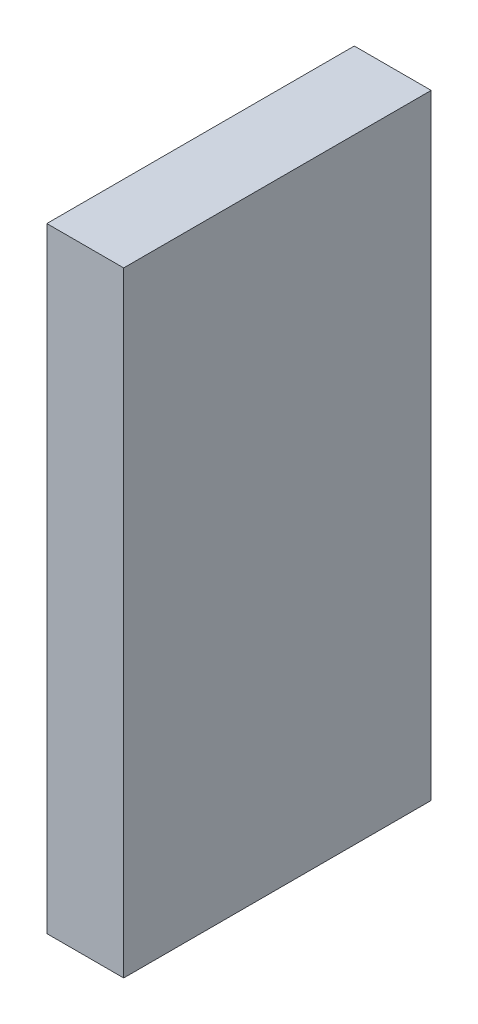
ISO-10303-21;
HEADER;
FILE_DESCRIPTION(('STEP AP214'),'2;1');
FILE_NAME('part.step','',(''),(''),'','','');
FILE_SCHEMA(('AUTOMOTIVE_DESIGN { 1 0 10303 214 1 1 1 1 }'));
ENDSEC;
DATA;
#1=APPLICATION_CONTEXT('core data for automotive mechanical design processes');
#2=APPLICATION_PROTOCOL_DEFINITION('international standard','automotive_design',2000,#1);
#3=PRODUCT_CONTEXT('',#1,'mechanical');
#4=PRODUCT('Part','Part','',(#3));
#5=PRODUCT_RELATED_PRODUCT_CATEGORY('part','',(#4));
#6=PRODUCT_DEFINITION_FORMATION('','',#4);
#7=PRODUCT_DEFINITION_CONTEXT('part definition',#1,'design');
#8=PRODUCT_DEFINITION('design','',#6,#7);
#9=PRODUCT_DEFINITION_SHAPE('','',#8);
#10=(LENGTH_UNIT() NAMED_UNIT(*) SI_UNIT(.MILLI.,.METRE.));
#11=(NAMED_UNIT(*) PLANE_ANGLE_UNIT() SI_UNIT($,.RADIAN.));
#12=(NAMED_UNIT(*) SI_UNIT($,.STERADIAN.) SOLID_ANGLE_UNIT());
#13=UNCERTAINTY_MEASURE_WITH_UNIT(LENGTH_MEASURE(1.E-05),#10,'distance_accuracy_value','');
#14=(GEOMETRIC_REPRESENTATION_CONTEXT(3) GLOBAL_UNCERTAINTY_ASSIGNED_CONTEXT((#13)) GLOBAL_UNIT_ASSIGNED_CONTEXT((#10,
#11,#12)) REPRESENTATION_CONTEXT('',''));
#15=CARTESIAN_POINT('',(0.,0.,0.));
#16=DIRECTION('',(0.,0.,1.));
#17=DIRECTION('',(1.,0.,0.));
#18=AXIS2_PLACEMENT_3D('',#15,#16,#17);
#19=CARTESIAN_POINT('',(14.5216968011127,27.7339360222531,-30.1556443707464));
#20=DIRECTION('',(-1.,0.,0.));
#21=DIRECTION('',(0.,-1.,0.));
#22=AXIS2_PLACEMENT_3D('',#19,#20,#21);
#23=PLANE('',#22);
#24=DIRECTION('',(0.,1.,0.));
#25=VECTOR('',#24,1.);
#26=CARTESIAN_POINT('',(14.5216968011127,27.7339360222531,-10.));
#27=LINE('',#26,#25);
#28=CARTESIAN_POINT('',(14.5216968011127,7.73393602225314,-10.));
#29=VERTEX_POINT('',#28);
#30=CARTESIAN_POINT('',(14.5216968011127,27.7339360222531,-10.));
#31=VERTEX_POINT('',#30);
#32=EDGE_CURVE('E59',#29,#31,#27,.T.);
#33=ORIENTED_EDGE('',*,*,#32,.F.);
#34=DIRECTION('',(0.,0.,1.));
#35=VECTOR('',#34,1.);
#36=CARTESIAN_POINT('',(14.5216968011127,7.73393602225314,-30.1556443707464));
#37=LINE('',#36,#35);
#38=CARTESIAN_POINT('',(14.5216968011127,7.73393602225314,0.));
#39=VERTEX_POINT('',#38);
#40=EDGE_CURVE('E85',#29,#39,#37,.T.);
#41=ORIENTED_EDGE('',*,*,#40,.T.);
#42=DIRECTION('',(0.,-1.,0.));
#43=VECTOR('',#42,1.);
#44=CARTESIAN_POINT('',(14.5216968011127,27.7339360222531,0.));
#45=LINE('',#44,#43);
#46=CARTESIAN_POINT('',(14.5216968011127,27.7339360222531,0.));
#47=VERTEX_POINT('',#46);
#48=EDGE_CURVE('E89',#47,#39,#45,.T.);
#49=ORIENTED_EDGE('',*,*,#48,.F.);
#50=DIRECTION('',(0.,0.,1.));
#51=VECTOR('',#50,1.);
#52=CARTESIAN_POINT('',(14.5216968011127,27.7339360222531,-30.1556443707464));
#53=LINE('',#52,#51);
#54=EDGE_CURVE('E130',#31,#47,#53,.T.);
#55=ORIENTED_EDGE('',*,*,#54,.F.);
#56=EDGE_LOOP('',(#33,#41,#49,#55));
#57=FACE_BOUND('',#56,.T.);
#58=ADVANCED_FACE('F49',(#57),#23,.T.);
#59=CARTESIAN_POINT('',(14.5216968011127,27.7339360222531,-30.1556443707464));
#60=DIRECTION('',(0.,1.,0.));
#61=DIRECTION('',(0.,0.,1.));
#62=AXIS2_PLACEMENT_3D('',#59,#60,#61);
#63=PLANE('',#62);
#64=DIRECTION('',(1.,0.,0.));
#65=VECTOR('',#64,1.);
#66=CARTESIAN_POINT('',(14.5216968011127,27.7339360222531,-10.));
#67=LINE('',#66,#65);
#68=CARTESIAN_POINT('',(17.0216968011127,27.7339360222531,-10.));
#69=VERTEX_POINT('',#68);
#70=EDGE_CURVE('E174',#31,#69,#67,.T.);
#71=ORIENTED_EDGE('',*,*,#70,.F.);
#72=ORIENTED_EDGE('',*,*,#54,.T.);
#73=DIRECTION('',(-1.,0.,0.));
#74=VECTOR('',#73,1.);
#75=CARTESIAN_POINT('',(14.5216968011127,27.7339360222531,0.));
#76=LINE('',#75,#74);
#77=CARTESIAN_POINT('',(17.0216968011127,27.7339360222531,0.));
#78=VERTEX_POINT('',#77);
#79=EDGE_CURVE('E94',#78,#47,#76,.T.);
#80=ORIENTED_EDGE('',*,*,#79,.F.);
#81=DIRECTION('',(0.,0.,1.));
#82=VECTOR('',#81,1.);
#83=CARTESIAN_POINT('',(17.0216968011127,27.7339360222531,-30.1556443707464));
#84=LINE('',#83,#82);
#85=EDGE_CURVE('E136',#69,#78,#84,.T.);
#86=ORIENTED_EDGE('',*,*,#85,.F.);
#87=EDGE_LOOP('',(#71,#72,#80,#86));
#88=FACE_BOUND('',#87,.T.);
#89=ADVANCED_FACE('F208',(#88),#63,.T.);
#90=CARTESIAN_POINT('',(17.0216968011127,27.7339360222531,-30.1556443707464));
#91=DIRECTION('',(1.,0.,0.));
#92=DIRECTION('',(0.,0.,-1.));
#93=AXIS2_PLACEMENT_3D('',#90,#91,#92);
#94=PLANE('',#93);
#95=DIRECTION('',(0.,-1.,0.));
#96=VECTOR('',#95,1.);
#97=CARTESIAN_POINT('',(17.0216968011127,27.7339360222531,-10.));
#98=LINE('',#97,#96);
#99=CARTESIAN_POINT('',(17.0216968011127,7.73393602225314,-10.));
#100=VERTEX_POINT('',#99);
#101=EDGE_CURVE('E135',#69,#100,#98,.T.);
#102=ORIENTED_EDGE('',*,*,#101,.F.);
#103=ORIENTED_EDGE('',*,*,#85,.T.);
#104=DIRECTION('',(0.,1.,0.));
#105=VECTOR('',#104,1.);
#106=CARTESIAN_POINT('',(17.0216968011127,27.7339360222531,0.));
#107=LINE('',#106,#105);
#108=CARTESIAN_POINT('',(17.0216968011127,7.73393602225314,0.));
#109=VERTEX_POINT('',#108);
#110=EDGE_CURVE('E103',#109,#78,#107,.T.);
#111=ORIENTED_EDGE('',*,*,#110,.F.);
#112=DIRECTION('',(0.,0.,1.));
#113=VECTOR('',#112,1.);
#114=CARTESIAN_POINT('',(17.0216968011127,7.73393602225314,-30.1556443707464));
#115=LINE('',#114,#113);
#116=EDGE_CURVE('E93',#100,#109,#115,.T.);
#117=ORIENTED_EDGE('',*,*,#116,.F.);
#118=EDGE_LOOP('',(#102,#103,#111,#117));
#119=FACE_BOUND('',#118,.T.);
#120=ADVANCED_FACE('F210',(#119),#94,.T.);
#121=CARTESIAN_POINT('',(14.5216968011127,7.73393602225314,-30.1556443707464));
#122=DIRECTION('',(0.,-1.,0.));
#123=DIRECTION('',(0.,0.,-1.));
#124=AXIS2_PLACEMENT_3D('',#121,#122,#123);
#125=PLANE('',#124);
#126=DIRECTION('',(-1.,0.,0.));
#127=VECTOR('',#126,1.);
#128=CARTESIAN_POINT('',(14.5216968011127,7.73393602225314,-10.));
#129=LINE('',#128,#127);
#130=EDGE_CURVE('E12',#100,#29,#129,.T.);
#131=ORIENTED_EDGE('',*,*,#130,.F.);
#132=ORIENTED_EDGE('',*,*,#116,.T.);
#133=DIRECTION('',(1.,0.,0.));
#134=VECTOR('',#133,1.);
#135=CARTESIAN_POINT('',(14.5216968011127,7.73393602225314,0.));
#136=LINE('',#135,#134);
#137=EDGE_CURVE('E96',#39,#109,#136,.T.);
#138=ORIENTED_EDGE('',*,*,#137,.F.);
#139=ORIENTED_EDGE('',*,*,#40,.F.);
#140=EDGE_LOOP('',(#131,#132,#138,#139));
#141=FACE_BOUND('',#140,.T.);
#142=ADVANCED_FACE('F97',(#141),#125,.T.);
#143=CARTESIAN_POINT('',(14.5216968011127,7.73393602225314,0.));
#144=DIRECTION('',(0.,0.,1.));
#145=DIRECTION('',(1.,0.,0.));
#146=AXIS2_PLACEMENT_3D('',#143,#144,#145);
#147=PLANE('',#146);
#148=ORIENTED_EDGE('',*,*,#48,.T.);
#149=ORIENTED_EDGE('',*,*,#137,.T.);
#150=ORIENTED_EDGE('',*,*,#110,.T.);
#151=ORIENTED_EDGE('',*,*,#79,.T.);
#152=EDGE_LOOP('',(#148,#149,#150,#151));
#153=FACE_BOUND('',#152,.T.);
#154=ADVANCED_FACE('F104',(#153),#147,.T.);
#155=CARTESIAN_POINT('',(14.5216968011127,7.73393602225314,-10.));
#156=DIRECTION('',(0.,0.,1.));
#157=DIRECTION('',(1.,0.,0.));
#158=AXIS2_PLACEMENT_3D('',#155,#156,#157);
#159=PLANE('',#158);
#160=ORIENTED_EDGE('',*,*,#32,.T.);
#161=ORIENTED_EDGE('',*,*,#70,.T.);
#162=ORIENTED_EDGE('',*,*,#101,.T.);
#163=ORIENTED_EDGE('',*,*,#130,.T.);
#164=EDGE_LOOP('',(#160,#161,#162,#163));
#165=FACE_BOUND('',#164,.T.);
#166=ADVANCED_FACE('F204',(#165),#159,.F.);
#167=CLOSED_SHELL('',(#58,#89,#120,#142,#154,#166));
#168=MANIFOLD_SOLID_BREP('B2',#167);
#169=ADVANCED_BREP_SHAPE_REPRESENTATION('',(#18,#168),#14);
#170=SHAPE_DEFINITION_REPRESENTATION(#9,#169);
ENDSEC;
END-ISO-10303-21;
